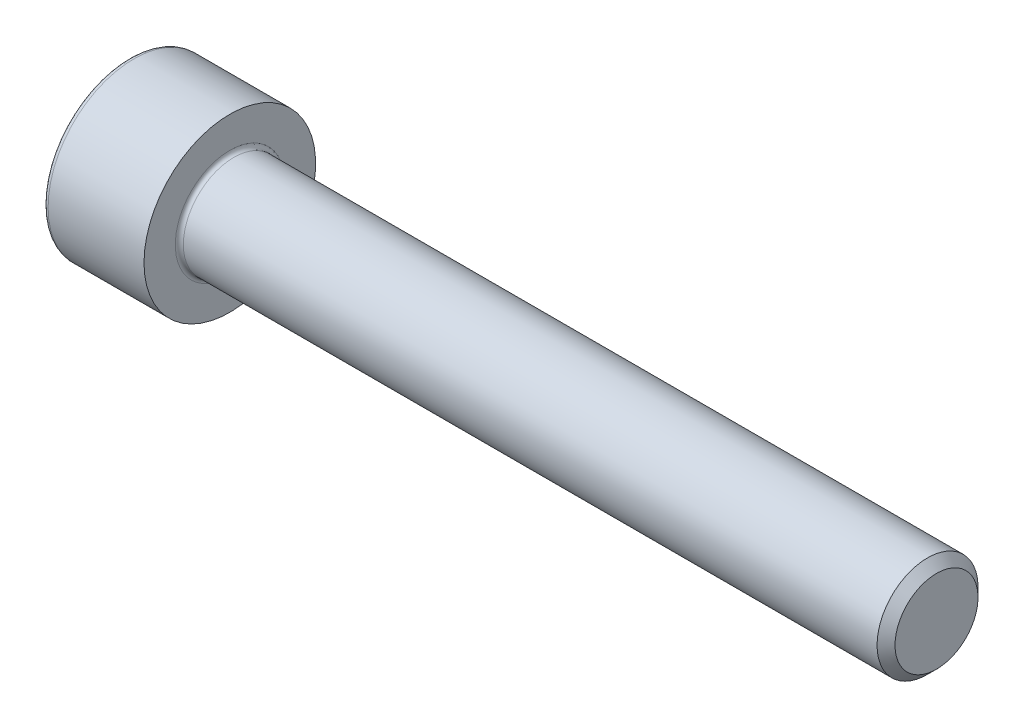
from build123d import *

# Parameters (mm, degrees)
FILLET1_R   = 0.2
FILLET2_R   = 0.25
HEX_2_DEPTH = 2.5


with BuildPart() as part:
    # BodySke → Base-Revolve (revolve)
    with BuildSketch(Plane.XY, mode=Mode.PRIVATE) as base_revolve_sk:
        Polygon((0, 0), (0, 4.25), (5, 4.25), (5, 2.5), (39.555, 2.5), (40, 2.055), (40, 0), align=None)
    revolve(base_revolve_sk.sketch.rotate(Axis((-31.75, 0, 0), (1, 0, 0)), 90), axis=Axis((-31.75, 0, 0), (1, 0, 0)))

    # Fillet1
    fillet1_edges = [part.edges().sort_by_distance(p)[0] for p in [
        (5, 0, -2.5),
    ]]
    fillet(fillet1_edges, radius=FILLET1_R)

    # Fillet2
    fillet2_edges = [part.edges().sort_by_distance(p)[0] for p in [
        (0, 0, -4.25),
    ]]
    fillet(fillet2_edges, radius=FILLET2_R)

    # Sketch2 → Hex-PreBroach (revolve, cut)
    with BuildSketch(Plane.XY, mode=Mode.PRIVATE) as hex_prebroach_sk:
        Polygon((0, 2.042), (2.5, 2.042), (3.67894925, 0), (0, 0), align=None)
    revolve(hex_prebroach_sk.sketch.rotate(Axis((0, 0, 0), (1, 0, 0)), 90), axis=Axis((0, 0, 0), (1, 0, 0)), mode=Mode.SUBTRACT)

    # Sketch3 → Hex 2 (cut)
    with BuildSketch(Plane(origin=(0, 0, 0), x_dir=(0, 0.500000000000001, 0.866025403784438), z_dir=(-1, 0, 0))):
        Polygon((1.17894925, 2.042), (-1.17894925, 2.042), (-2.357898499, 0), (-1.17894925, -2.042), (1.17894925, -2.042), (2.357898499, 0), align=None)
    extrude(amount=-HEX_2_DEPTH, mode=Mode.SUBTRACT)


solid = part.part
